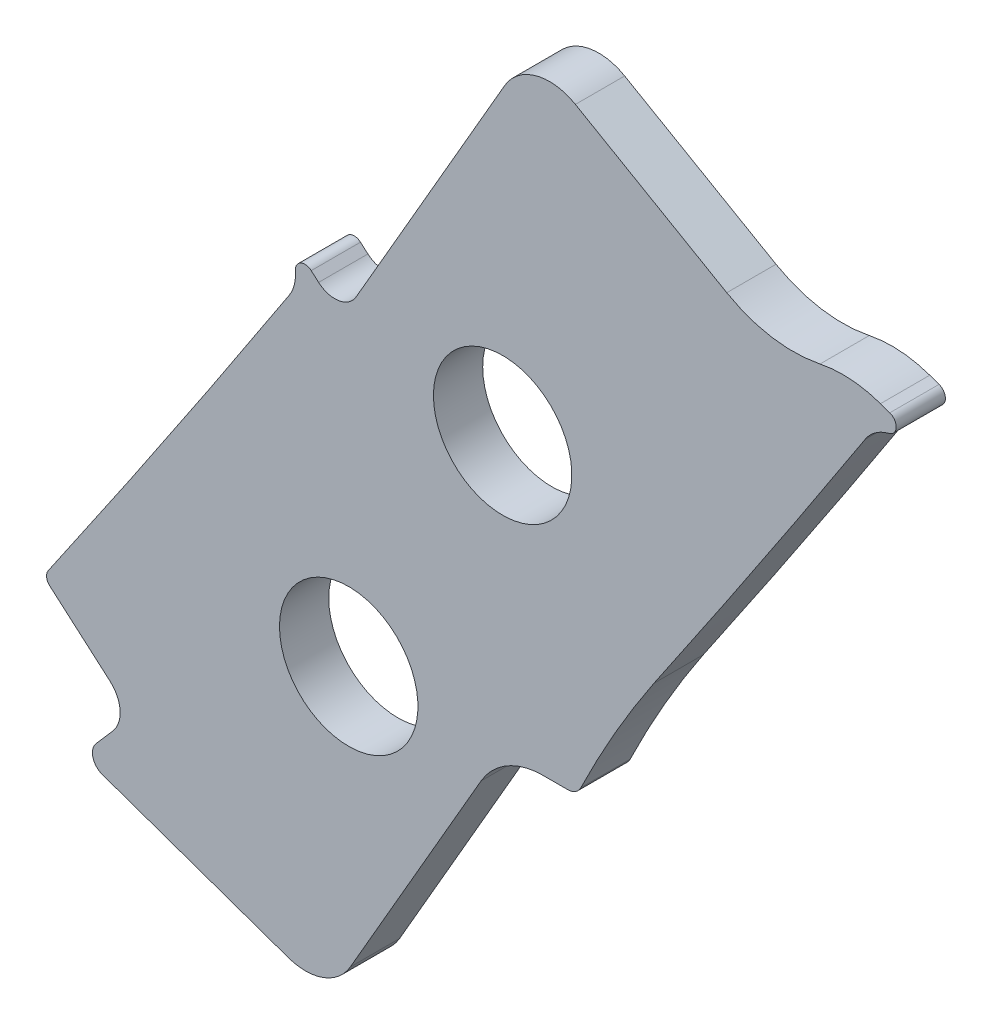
from build123d import *

# Parameters (mm, degrees)
BOSS_EXTRUDE1_DEPTH = 2.54
HOLE1_D             = 7.1374


with BuildPart() as part:
    # Sketch1 → Boss-Extrude1 (new body)
    with BuildSketch(Plane.XY):
        with BuildLine():
            Line((-1062.712487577, 28.45036562), (-1063.191598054, 28.619235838))
            ThreePointArc((-1063.191598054, 28.619235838), (-1064.736119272, 28.937927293), (-1066.309606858, 28.831876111))
            ThreePointArc((-1066.309606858, 28.831876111), (-1068.785823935, 28.77958335), (-1071.119130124, 29.610286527))
            Line((-1071.119130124, 29.610286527), (-1078.923254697, 34.11599995))
            ThreePointArc((-1078.923254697, 34.11599995), (-1080.94702509, 34.382434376), (-1082.566444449, 33.139810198))
            Line((-1082.566444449, 33.139810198), (-1090.227563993, 19.870361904))
            ThreePointArc((-1090.227563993, 19.870361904), (-1091.119115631, 19.252560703), (-1092.162613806, 19.548625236))
            Line((-1092.162613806, 19.548625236), (-1092.545308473, 19.882704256))
            ThreePointArc((-1092.545308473, 19.882704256), (-1093.089247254, 19.951944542), (-1093.359453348, 19.474815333))
            ThreePointArc((-1093.359453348, 19.474815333), (-1093.417404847, 18.815859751), (-1093.68394172, 18.210435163))
            ThreePointArc((-1093.68394172, 18.210435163), (-1099.833526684, 8.91969734), (-1106.103117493, -0.290483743))
            ThreePointArc((-1106.103117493, -0.290483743), (-1106.186324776, -0.631690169), (-1106.020810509, -0.94144863))
            Line((-1106.020810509, -0.94144863), (-1102.920529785, -3.633822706))
            ThreePointArc((-1102.920529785, -3.633822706), (-1102.399566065, -4.677436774), (-1102.76913567, -5.783760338))
            Line((-1102.76913567, -5.783760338), (-1103.639082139, -6.785507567))
            ThreePointArc((-1103.639082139, -6.785507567), (-1103.800447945, -7.479871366), (-1103.317054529, -8.003809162))
            Line((-1103.317054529, -8.003809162), (-1093.725515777, -11.384501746))
            ThreePointArc((-1093.725515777, -11.384501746), (-1091.914015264, -11.37064931), (-1090.529257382, -10.202671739))
            Line((-1090.529257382, -10.202671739), (-1083.785676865, 1.477552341))
            ThreePointArc((-1083.785676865, 1.477552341), (-1082.437605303, 2.825623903), (-1080.596105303, 3.319052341))
            Line((-1080.596105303, 3.319052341), (-1079.326105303, 3.319052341))
            ThreePointArc((-1079.326105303, 3.319052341), (-1078.921828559, 3.43513879), (-1078.640730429, 3.748027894))
            ThreePointArc((-1078.640730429, 3.748027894), (-1076.870699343, 7.087972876), (-1074.871263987, 10.295853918))
            ThreePointArc((-1074.871263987, 10.295853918), (-1069.37500172, 18.438072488), (-1063.97367378, 26.643575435))
            ThreePointArc((-1063.97367378, 26.643575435), (-1063.448072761, 27.191798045), (-1062.757890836, 27.508741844))
            ThreePointArc((-1062.757890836, 27.508741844), (-1062.384609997, 27.962649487), (-1062.712487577, 28.45036562))
        make_face()
    extrude(amount=-BOSS_EXTRUDE1_DEPTH)

    # Hole1 (through all)
    with Locations(Plane(origin=(-1077.496739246, 28.063640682, -2.54), x_dir=(-1, 0, 0), z_dir=(0, 0, -1))):
        with Locations((5.178260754, -10.601140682), (13.115760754, -24.888640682)):
            Hole(HOLE1_D / 2)


solid = part.part
